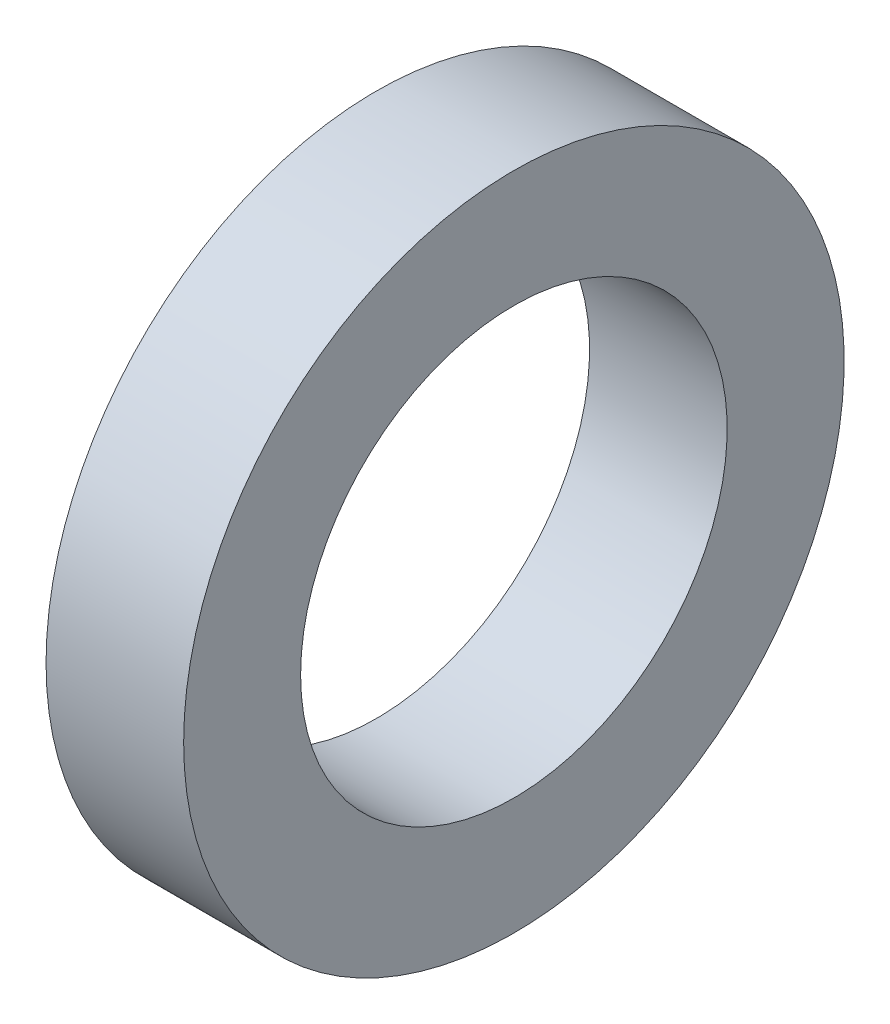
ISO-10303-21;
HEADER;
FILE_DESCRIPTION(('STEP AP214'),'2;1');
FILE_NAME('part.step','',(''),(''),'','','');
FILE_SCHEMA(('AUTOMOTIVE_DESIGN { 1 0 10303 214 1 1 1 1 }'));
ENDSEC;
DATA;
#1=APPLICATION_CONTEXT('core data for automotive mechanical design processes');
#2=APPLICATION_PROTOCOL_DEFINITION('international standard','automotive_design',2000,#1);
#3=PRODUCT_CONTEXT('',#1,'mechanical');
#4=PRODUCT('Part','Part','',(#3));
#5=PRODUCT_RELATED_PRODUCT_CATEGORY('part','',(#4));
#6=PRODUCT_DEFINITION_FORMATION('','',#4);
#7=PRODUCT_DEFINITION_CONTEXT('part definition',#1,'design');
#8=PRODUCT_DEFINITION('design','',#6,#7);
#9=PRODUCT_DEFINITION_SHAPE('','',#8);
#10=(LENGTH_UNIT() NAMED_UNIT(*) SI_UNIT(.MILLI.,.METRE.));
#11=(NAMED_UNIT(*) PLANE_ANGLE_UNIT() SI_UNIT($,.RADIAN.));
#12=(NAMED_UNIT(*) SI_UNIT($,.STERADIAN.) SOLID_ANGLE_UNIT());
#13=UNCERTAINTY_MEASURE_WITH_UNIT(LENGTH_MEASURE(1.E-05),#10,'distance_accuracy_value','');
#14=(GEOMETRIC_REPRESENTATION_CONTEXT(3) GLOBAL_UNCERTAINTY_ASSIGNED_CONTEXT((#13)) GLOBAL_UNIT_ASSIGNED_CONTEXT((#10,
#11,#12)) REPRESENTATION_CONTEXT('',''));
#15=CARTESIAN_POINT('',(0.,0.,0.));
#16=DIRECTION('',(0.,0.,1.));
#17=DIRECTION('',(1.,0.,0.));
#18=AXIS2_PLACEMENT_3D('',#15,#16,#17);
#19=CARTESIAN_POINT('',(5.,12.,0.));
#20=DIRECTION('',(-1.,0.,0.));
#21=DIRECTION('',(0.,0.,1.));
#22=AXIS2_PLACEMENT_3D('',#19,#20,#21);
#23=PLANE('',#22);
#24=CARTESIAN_POINT('',(5.,0.,0.));
#25=DIRECTION('',(-1.,0.,0.));
#26=DIRECTION('',(0.,0.,1.));
#27=AXIS2_PLACEMENT_3D('',#24,#25,#26);
#28=CIRCLE('',#27,7.75);
#29=CARTESIAN_POINT('',(5.,0.,7.75));
#30=VERTEX_POINT('',#29);
#31=EDGE_CURVE('E17',#30,#30,#28,.T.);
#32=ORIENTED_EDGE('',*,*,#31,.T.);
#33=EDGE_LOOP('',(#32));
#34=FACE_BOUND('',#33,.T.);
#35=CARTESIAN_POINT('',(5.,0.,0.));
#36=DIRECTION('',(-1.,0.,0.));
#37=DIRECTION('',(0.,0.,1.));
#38=AXIS2_PLACEMENT_3D('',#35,#36,#37);
#39=CIRCLE('',#38,12.);
#40=CARTESIAN_POINT('',(5.,0.,12.));
#41=VERTEX_POINT('',#40);
#42=EDGE_CURVE('E26',#41,#41,#39,.T.);
#43=ORIENTED_EDGE('',*,*,#42,.F.);
#44=EDGE_LOOP('',(#43));
#45=FACE_BOUND('',#44,.T.);
#46=ADVANCED_FACE('F14',(#34,#45),#23,.F.);
#47=CARTESIAN_POINT('',(-3.86081268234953,0.,0.));
#48=DIRECTION('',(-1.,0.,0.));
#49=DIRECTION('',(0.,0.,1.));
#50=AXIS2_PLACEMENT_3D('',#47,#48,#49);
#51=CYLINDRICAL_SURFACE('',#50,7.75);
#52=ORIENTED_EDGE('',*,*,#31,.F.);
#53=EDGE_LOOP('',(#52));
#54=FACE_BOUND('',#53,.T.);
#55=CARTESIAN_POINT('',(0.,0.,0.));
#56=DIRECTION('',(-1.,0.,0.));
#57=DIRECTION('',(0.,0.,1.));
#58=AXIS2_PLACEMENT_3D('',#55,#56,#57);
#59=CIRCLE('',#58,7.75);
#60=CARTESIAN_POINT('',(0.,0.,7.75));
#61=VERTEX_POINT('',#60);
#62=EDGE_CURVE('E21',#61,#61,#59,.T.);
#63=ORIENTED_EDGE('',*,*,#62,.T.);
#64=EDGE_LOOP('',(#63));
#65=FACE_BOUND('',#64,.T.);
#66=ADVANCED_FACE('F36',(#54,#65),#51,.F.);
#67=CARTESIAN_POINT('',(-3.86081268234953,0.,0.));
#68=DIRECTION('',(-1.,0.,0.));
#69=DIRECTION('',(0.,0.,1.));
#70=AXIS2_PLACEMENT_3D('',#67,#68,#69);
#71=CYLINDRICAL_SURFACE('',#70,12.);
#72=CARTESIAN_POINT('',(0.,0.,0.));
#73=DIRECTION('',(-1.,0.,0.));
#74=DIRECTION('',(0.,0.,1.));
#75=AXIS2_PLACEMENT_3D('',#72,#73,#74);
#76=CIRCLE('',#75,12.);
#77=CARTESIAN_POINT('',(0.,0.,12.));
#78=VERTEX_POINT('',#77);
#79=EDGE_CURVE('E10',#78,#78,#76,.F.);
#80=ORIENTED_EDGE('',*,*,#79,.T.);
#81=EDGE_LOOP('',(#80));
#82=FACE_BOUND('',#81,.T.);
#83=ORIENTED_EDGE('',*,*,#42,.T.);
#84=EDGE_LOOP('',(#83));
#85=FACE_BOUND('',#84,.T.);
#86=ADVANCED_FACE('F39',(#82,#85),#71,.T.);
#87=CARTESIAN_POINT('',(0.,12.,0.));
#88=DIRECTION('',(1.,0.,0.));
#89=DIRECTION('',(0.,0.,-1.));
#90=AXIS2_PLACEMENT_3D('',#87,#88,#89);
#91=PLANE('',#90);
#92=ORIENTED_EDGE('',*,*,#79,.F.);
#93=EDGE_LOOP('',(#92));
#94=FACE_BOUND('',#93,.T.);
#95=ORIENTED_EDGE('',*,*,#62,.F.);
#96=EDGE_LOOP('',(#95));
#97=FACE_BOUND('',#96,.T.);
#98=ADVANCED_FACE('F42',(#94,#97),#91,.F.);
#99=CLOSED_SHELL('',(#46,#66,#86,#98));
#100=MANIFOLD_SOLID_BREP('B1',#99);
#101=ADVANCED_BREP_SHAPE_REPRESENTATION('',(#18,#100),#14);
#102=SHAPE_DEFINITION_REPRESENTATION(#9,#101);
ENDSEC;
END-ISO-10303-21;
